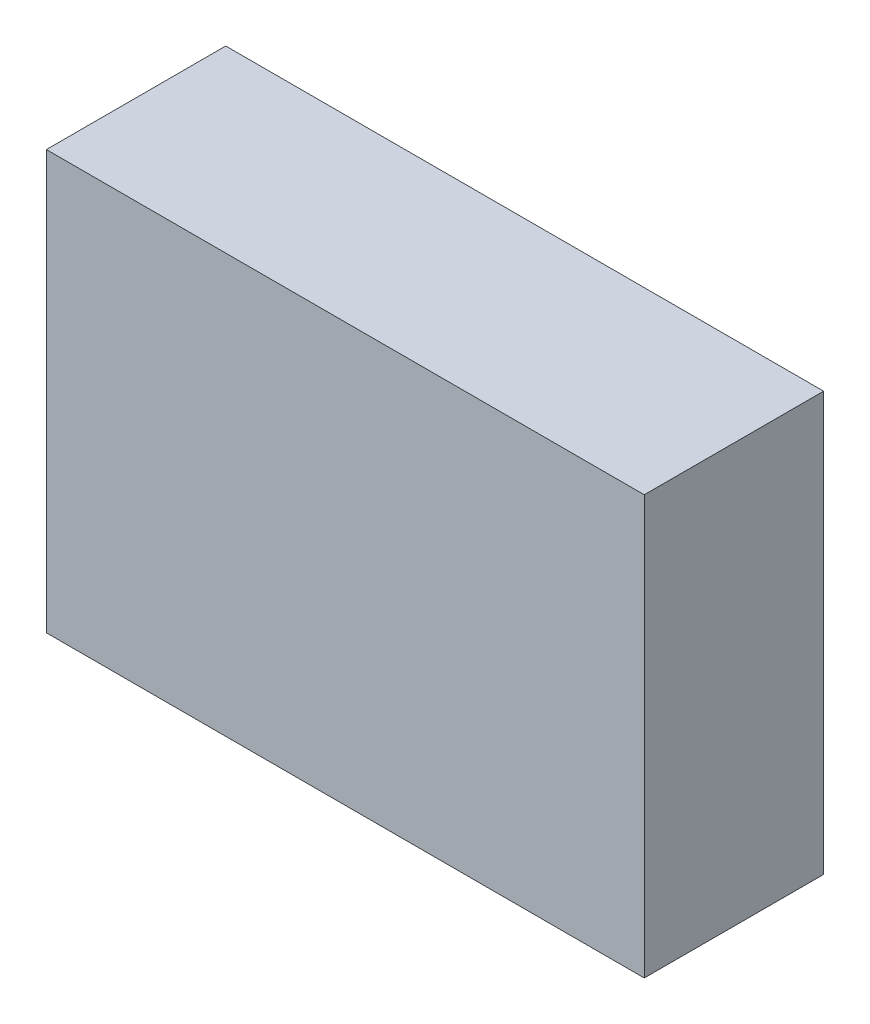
ISO-10303-21;
HEADER;
FILE_DESCRIPTION(('STEP AP214'),'2;1');
FILE_NAME('part.step','',(''),(''),'','','');
FILE_SCHEMA(('AUTOMOTIVE_DESIGN { 1 0 10303 214 1 1 1 1 }'));
ENDSEC;
DATA;
#1=APPLICATION_CONTEXT('core data for automotive mechanical design processes');
#2=APPLICATION_PROTOCOL_DEFINITION('international standard','automotive_design',2000,#1);
#3=PRODUCT_CONTEXT('',#1,'mechanical');
#4=PRODUCT('Part','Part','',(#3));
#5=PRODUCT_RELATED_PRODUCT_CATEGORY('part','',(#4));
#6=PRODUCT_DEFINITION_FORMATION('','',#4);
#7=PRODUCT_DEFINITION_CONTEXT('part definition',#1,'design');
#8=PRODUCT_DEFINITION('design','',#6,#7);
#9=PRODUCT_DEFINITION_SHAPE('','',#8);
#10=(LENGTH_UNIT() NAMED_UNIT(*) SI_UNIT(.MILLI.,.METRE.));
#11=(NAMED_UNIT(*) PLANE_ANGLE_UNIT() SI_UNIT($,.RADIAN.));
#12=(NAMED_UNIT(*) SI_UNIT($,.STERADIAN.) SOLID_ANGLE_UNIT());
#13=UNCERTAINTY_MEASURE_WITH_UNIT(LENGTH_MEASURE(1.E-05),#10,'distance_accuracy_value','');
#14=(GEOMETRIC_REPRESENTATION_CONTEXT(3) GLOBAL_UNCERTAINTY_ASSIGNED_CONTEXT((#13)) GLOBAL_UNIT_ASSIGNED_CONTEXT((#10,
#11,#12)) REPRESENTATION_CONTEXT('',''));
#15=CARTESIAN_POINT('',(0.,0.,0.));
#16=DIRECTION('',(0.,0.,1.));
#17=DIRECTION('',(1.,0.,0.));
#18=AXIS2_PLACEMENT_3D('',#15,#16,#17);
#19=CARTESIAN_POINT('',(5.,7.,1.5));
#20=DIRECTION('',(-1.,0.,0.));
#21=DIRECTION('',(0.,0.,1.));
#22=AXIS2_PLACEMENT_3D('',#19,#20,#21);
#23=PLANE('',#22);
#24=DIRECTION('',(0.,0.,-1.));
#25=VECTOR('',#24,1.);
#26=CARTESIAN_POINT('',(5.,0.,1.5));
#27=LINE('',#26,#25);
#28=CARTESIAN_POINT('',(5.,0.,1.5));
#29=VERTEX_POINT('',#28);
#30=CARTESIAN_POINT('',(5.,0.,-1.5));
#31=VERTEX_POINT('',#30);
#32=EDGE_CURVE('E107',#29,#31,#27,.T.);
#33=ORIENTED_EDGE('',*,*,#32,.T.);
#34=DIRECTION('',(0.,-1.,0.));
#35=VECTOR('',#34,1.);
#36=CARTESIAN_POINT('',(5.,7.,-1.5));
#37=LINE('',#36,#35);
#38=CARTESIAN_POINT('',(5.,7.,-1.5));
#39=VERTEX_POINT('',#38);
#40=EDGE_CURVE('E11',#39,#31,#37,.T.);
#41=ORIENTED_EDGE('',*,*,#40,.F.);
#42=DIRECTION('',(0.,0.,-1.));
#43=VECTOR('',#42,1.);
#44=CARTESIAN_POINT('',(5.,7.,1.5));
#45=LINE('',#44,#43);
#46=CARTESIAN_POINT('',(5.,7.,1.5));
#47=VERTEX_POINT('',#46);
#48=EDGE_CURVE('E91',#47,#39,#45,.T.);
#49=ORIENTED_EDGE('',*,*,#48,.F.);
#50=DIRECTION('',(0.,-1.,0.));
#51=VECTOR('',#50,1.);
#52=CARTESIAN_POINT('',(5.,7.,1.5));
#53=LINE('',#52,#51);
#54=EDGE_CURVE('E103',#47,#29,#53,.T.);
#55=ORIENTED_EDGE('',*,*,#54,.T.);
#56=EDGE_LOOP('',(#33,#41,#49,#55));
#57=FACE_BOUND('',#56,.T.);
#58=ADVANCED_FACE('F39',(#57),#23,.F.);
#59=CARTESIAN_POINT('',(-5.,7.,-1.5));
#60=DIRECTION('',(0.,0.,1.));
#61=DIRECTION('',(1.,0.,0.));
#62=AXIS2_PLACEMENT_3D('',#59,#60,#61);
#63=PLANE('',#62);
#64=DIRECTION('',(-1.,0.,0.));
#65=VECTOR('',#64,1.);
#66=CARTESIAN_POINT('',(-5.,0.,-1.5));
#67=LINE('',#66,#65);
#68=CARTESIAN_POINT('',(-5.,0.,-1.5));
#69=VERTEX_POINT('',#68);
#70=EDGE_CURVE('E96',#31,#69,#67,.T.);
#71=ORIENTED_EDGE('',*,*,#70,.T.);
#72=DIRECTION('',(0.,-1.,0.));
#73=VECTOR('',#72,1.);
#74=CARTESIAN_POINT('',(-5.,7.,-1.5));
#75=LINE('',#74,#73);
#76=CARTESIAN_POINT('',(-5.,7.,-1.5));
#77=VERTEX_POINT('',#76);
#78=EDGE_CURVE('E48',#77,#69,#75,.T.);
#79=ORIENTED_EDGE('',*,*,#78,.F.);
#80=DIRECTION('',(-1.,0.,0.));
#81=VECTOR('',#80,1.);
#82=CARTESIAN_POINT('',(-5.,7.,-1.5));
#83=LINE('',#82,#81);
#84=EDGE_CURVE('E86',#39,#77,#83,.T.);
#85=ORIENTED_EDGE('',*,*,#84,.F.);
#86=ORIENTED_EDGE('',*,*,#40,.T.);
#87=EDGE_LOOP('',(#71,#79,#85,#86));
#88=FACE_BOUND('',#87,.T.);
#89=ADVANCED_FACE('F95',(#88),#63,.F.);
#90=CARTESIAN_POINT('',(-5.,7.,1.5));
#91=DIRECTION('',(1.,0.,0.));
#92=DIRECTION('',(0.,0.,-1.));
#93=AXIS2_PLACEMENT_3D('',#90,#91,#92);
#94=PLANE('',#93);
#95=DIRECTION('',(0.,0.,1.));
#96=VECTOR('',#95,1.);
#97=CARTESIAN_POINT('',(-5.,0.,1.5));
#98=LINE('',#97,#96);
#99=CARTESIAN_POINT('',(-5.,0.,1.5));
#100=VERTEX_POINT('',#99);
#101=EDGE_CURVE('E73',#69,#100,#98,.T.);
#102=ORIENTED_EDGE('',*,*,#101,.T.);
#103=DIRECTION('',(0.,-1.,0.));
#104=VECTOR('',#103,1.);
#105=CARTESIAN_POINT('',(-5.,7.,1.5));
#106=LINE('',#105,#104);
#107=CARTESIAN_POINT('',(-5.,7.,1.5));
#108=VERTEX_POINT('',#107);
#109=EDGE_CURVE('E98',#108,#100,#106,.T.);
#110=ORIENTED_EDGE('',*,*,#109,.F.);
#111=DIRECTION('',(0.,0.,1.));
#112=VECTOR('',#111,1.);
#113=CARTESIAN_POINT('',(-5.,7.,1.5));
#114=LINE('',#113,#112);
#115=EDGE_CURVE('E89',#77,#108,#114,.T.);
#116=ORIENTED_EDGE('',*,*,#115,.F.);
#117=ORIENTED_EDGE('',*,*,#78,.T.);
#118=EDGE_LOOP('',(#102,#110,#116,#117));
#119=FACE_BOUND('',#118,.T.);
#120=ADVANCED_FACE('F99',(#119),#94,.F.);
#121=CARTESIAN_POINT('',(-5.,7.,1.5));
#122=DIRECTION('',(0.,0.,-1.));
#123=DIRECTION('',(-1.,0.,0.));
#124=AXIS2_PLACEMENT_3D('',#121,#122,#123);
#125=PLANE('',#124);
#126=DIRECTION('',(1.,0.,0.));
#127=VECTOR('',#126,1.);
#128=CARTESIAN_POINT('',(-5.,0.,1.5));
#129=LINE('',#128,#127);
#130=EDGE_CURVE('E79',#100,#29,#129,.T.);
#131=ORIENTED_EDGE('',*,*,#130,.T.);
#132=ORIENTED_EDGE('',*,*,#54,.F.);
#133=DIRECTION('',(1.,0.,0.));
#134=VECTOR('',#133,1.);
#135=CARTESIAN_POINT('',(-5.,7.,1.5));
#136=LINE('',#135,#134);
#137=EDGE_CURVE('E56',#108,#47,#136,.T.);
#138=ORIENTED_EDGE('',*,*,#137,.F.);
#139=ORIENTED_EDGE('',*,*,#109,.T.);
#140=EDGE_LOOP('',(#131,#132,#138,#139));
#141=FACE_BOUND('',#140,.T.);
#142=ADVANCED_FACE('F120',(#141),#125,.F.);
#143=CARTESIAN_POINT('',(0.,7.,0.));
#144=DIRECTION('',(0.,-1.,0.));
#145=DIRECTION('',(0.,0.,-1.));
#146=AXIS2_PLACEMENT_3D('',#143,#144,#145);
#147=PLANE('',#146);
#148=ORIENTED_EDGE('',*,*,#48,.T.);
#149=ORIENTED_EDGE('',*,*,#84,.T.);
#150=ORIENTED_EDGE('',*,*,#115,.T.);
#151=ORIENTED_EDGE('',*,*,#137,.T.);
#152=EDGE_LOOP('',(#148,#149,#150,#151));
#153=FACE_BOUND('',#152,.T.);
#154=ADVANCED_FACE('F87',(#153),#147,.F.);
#155=CARTESIAN_POINT('',(0.,0.,0.));
#156=DIRECTION('',(0.,-1.,0.));
#157=DIRECTION('',(0.,0.,-1.));
#158=AXIS2_PLACEMENT_3D('',#155,#156,#157);
#159=PLANE('',#158);
#160=ORIENTED_EDGE('',*,*,#32,.F.);
#161=ORIENTED_EDGE('',*,*,#130,.F.);
#162=ORIENTED_EDGE('',*,*,#101,.F.);
#163=ORIENTED_EDGE('',*,*,#70,.F.);
#164=EDGE_LOOP('',(#160,#161,#162,#163));
#165=FACE_BOUND('',#164,.T.);
#166=ADVANCED_FACE('F123',(#165),#159,.T.);
#167=CLOSED_SHELL('',(#58,#89,#120,#142,#154,#166));
#168=MANIFOLD_SOLID_BREP('B2',#167);
#169=ADVANCED_BREP_SHAPE_REPRESENTATION('',(#18,#168),#14);
#170=SHAPE_DEFINITION_REPRESENTATION(#9,#169);
ENDSEC;
END-ISO-10303-21;
